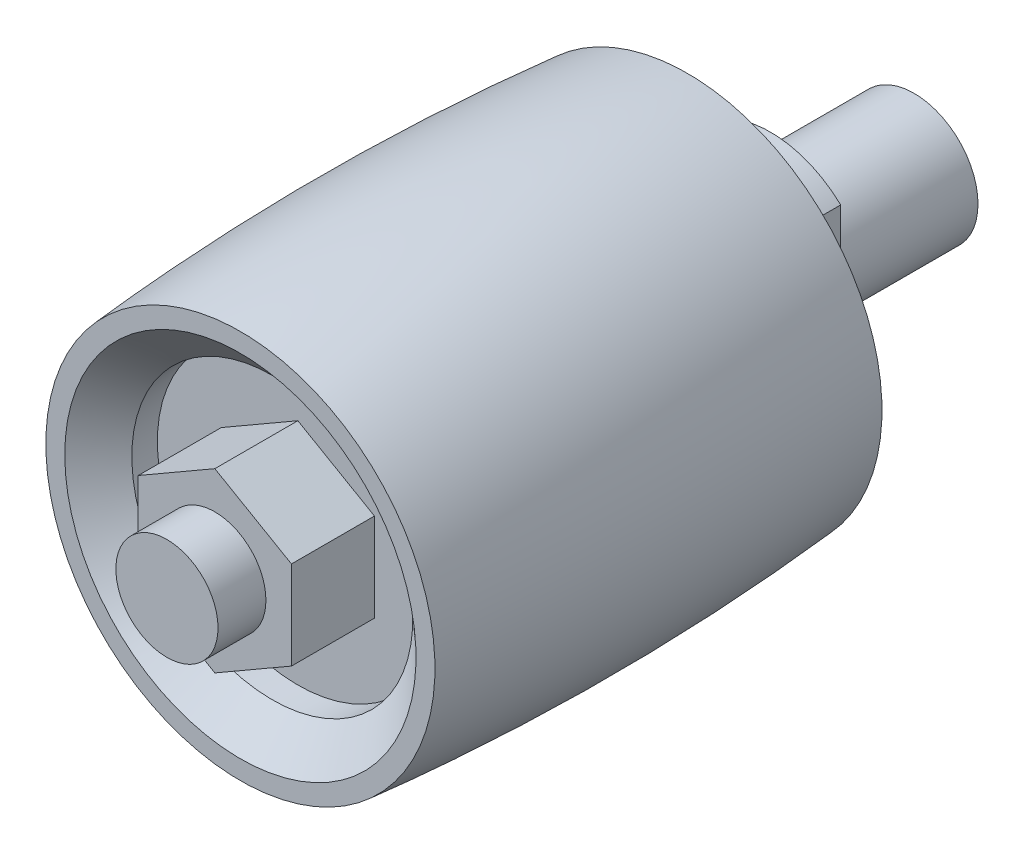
ISO-10303-21;
HEADER;
FILE_DESCRIPTION(('STEP AP214'),'2;1');
FILE_NAME('part.step','',(''),(''),'','','');
FILE_SCHEMA(('AUTOMOTIVE_DESIGN { 1 0 10303 214 1 1 1 1 }'));
ENDSEC;
DATA;
#1=APPLICATION_CONTEXT('core data for automotive mechanical design processes');
#2=APPLICATION_PROTOCOL_DEFINITION('international standard','automotive_design',2000,#1);
#3=PRODUCT_CONTEXT('',#1,'mechanical');
#4=PRODUCT('Part','Part','',(#3));
#5=PRODUCT_RELATED_PRODUCT_CATEGORY('part','',(#4));
#6=PRODUCT_DEFINITION_FORMATION('','',#4);
#7=PRODUCT_DEFINITION_CONTEXT('part definition',#1,'design');
#8=PRODUCT_DEFINITION('design','',#6,#7);
#9=PRODUCT_DEFINITION_SHAPE('','',#8);
#10=(LENGTH_UNIT() NAMED_UNIT(*) SI_UNIT(.MILLI.,.METRE.));
#11=(NAMED_UNIT(*) PLANE_ANGLE_UNIT() SI_UNIT($,.RADIAN.));
#12=(NAMED_UNIT(*) SI_UNIT($,.STERADIAN.) SOLID_ANGLE_UNIT());
#13=UNCERTAINTY_MEASURE_WITH_UNIT(LENGTH_MEASURE(1.E-05),#10,'distance_accuracy_value','');
#14=(GEOMETRIC_REPRESENTATION_CONTEXT(3) GLOBAL_UNCERTAINTY_ASSIGNED_CONTEXT((#13)) GLOBAL_UNIT_ASSIGNED_CONTEXT((#10,
#11,#12)) REPRESENTATION_CONTEXT('',''));
#15=CARTESIAN_POINT('',(0.,0.,0.));
#16=DIRECTION('',(0.,0.,1.));
#17=DIRECTION('',(1.,0.,0.));
#18=AXIS2_PLACEMENT_3D('',#15,#16,#17);
#19=CARTESIAN_POINT('',(0.,0.,28.));
#20=DIRECTION('',(0.,0.,-1.));
#21=DIRECTION('',(-0.381849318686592,0.924224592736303,0.));
#22=AXIS2_PLACEMENT_3D('',#19,#20,#21);
#23=CYLINDRICAL_SURFACE('',#22,22.);
#24=CARTESIAN_POINT('',(0.,0.,78.));
#25=DIRECTION('',(0.,0.,-1.));
#26=DIRECTION('',(-0.381849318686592,0.924224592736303,0.));
#27=AXIS2_PLACEMENT_3D('',#24,#25,#26);
#28=CIRCLE('',#27,22.);
#29=CARTESIAN_POINT('',(-8.40068501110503,20.3329410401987,78.));
#30=VERTEX_POINT('',#29);
#31=EDGE_CURVE('E194',#30,#30,#28,.T.);
#32=ORIENTED_EDGE('',*,*,#31,.F.);
#33=EDGE_LOOP('',(#32));
#34=FACE_BOUND('',#33,.T.);
#35=CARTESIAN_POINT('',(0.,0.,74.));
#36=DIRECTION('',(0.,0.,-1.));
#37=DIRECTION('',(-0.381849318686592,0.924224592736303,0.));
#38=AXIS2_PLACEMENT_3D('',#35,#36,#37);
#39=CIRCLE('',#38,22.);
#40=CARTESIAN_POINT('',(-8.40068501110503,20.3329410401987,74.));
#41=VERTEX_POINT('',#40);
#42=EDGE_CURVE('E19',#41,#41,#39,.T.);
#43=ORIENTED_EDGE('',*,*,#42,.T.);
#44=EDGE_LOOP('',(#43));
#45=FACE_BOUND('',#44,.T.);
#46=ADVANCED_FACE('F15',(#34,#45),#23,.F.);
#47=CARTESIAN_POINT('',(0.,0.,78.));
#48=DIRECTION('',(0.,0.,1.));
#49=DIRECTION('',(0.381849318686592,-0.924224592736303,0.));
#50=AXIS2_PLACEMENT_3D('',#47,#48,#49);
#51=CONICAL_SURFACE('',#50,22.,0.832981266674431);
#52=CARTESIAN_POINT('',(0.,0.,83.));
#53=DIRECTION('',(0.,0.,-1.));
#54=DIRECTION('',(-0.381849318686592,0.924224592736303,0.));
#55=AXIS2_PLACEMENT_3D('',#52,#53,#54);
#56=CIRCLE('',#55,27.5);
#57=CARTESIAN_POINT('',(-10.5008562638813,25.4161763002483,83.));
#58=VERTEX_POINT('',#57);
#59=EDGE_CURVE('E192',#58,#58,#56,.T.);
#60=ORIENTED_EDGE('',*,*,#59,.F.);
#61=EDGE_LOOP('',(#60));
#62=FACE_BOUND('',#61,.T.);
#63=ORIENTED_EDGE('',*,*,#31,.T.);
#64=EDGE_LOOP('',(#63));
#65=FACE_BOUND('',#64,.T.);
#66=ADVANCED_FACE('F279',(#62,#65),#51,.F.);
#67=CARTESIAN_POINT('',(30.0372992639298,12.4101028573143,83.));
#68=DIRECTION('',(0.,0.,1.));
#69=DIRECTION('',(0.381849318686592,-0.924224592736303,0.));
#70=AXIS2_PLACEMENT_3D('',#67,#68,#69);
#71=PLANE('',#70);
#72=CARTESIAN_POINT('',(0.,0.,83.));
#73=DIRECTION('',(0.,0.,-1.));
#74=DIRECTION('',(-0.381849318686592,0.924224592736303,0.));
#75=AXIS2_PLACEMENT_3D('',#72,#73,#74);
#76=CIRCLE('',#75,30.4658078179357);
#77=CARTESIAN_POINT('',(-11.6333479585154,28.1572488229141,83.));
#78=VERTEX_POINT('',#77);
#79=EDGE_CURVE('E180',#78,#78,#76,.T.);
#80=ORIENTED_EDGE('',*,*,#79,.F.);
#81=EDGE_LOOP('',(#80));
#82=FACE_BOUND('',#81,.T.);
#83=ORIENTED_EDGE('',*,*,#59,.T.);
#84=EDGE_LOOP('',(#83));
#85=FACE_BOUND('',#84,.T.);
#86=ADVANCED_FACE('F264',(#82,#85),#71,.T.);
#87=CARTESIAN_POINT('',(0.,0.,48.));
#88=DIRECTION('',(0.,0.,-1.));
#89=DIRECTION('',(-0.381849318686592,0.924224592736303,0.));
#90=AXIS2_PLACEMENT_3D('',#87,#88,#89);
#91=DEGENERATE_TOROIDAL_SURFACE('',#90,368.,400.,.F.);
#92=CARTESIAN_POINT('',(0.,0.,13.));
#93=DIRECTION('',(0.,0.,-1.));
#94=DIRECTION('',(-0.381849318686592,0.924224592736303,0.));
#95=AXIS2_PLACEMENT_3D('',#92,#93,#94);
#96=CIRCLE('',#95,30.4658078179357);
#97=CARTESIAN_POINT('',(-11.6333479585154,28.1572488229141,13.));
#98=VERTEX_POINT('',#97);
#99=EDGE_CURVE('E177',#98,#98,#96,.T.);
#100=ORIENTED_EDGE('',*,*,#99,.F.);
#101=EDGE_LOOP('',(#100));
#102=FACE_BOUND('',#101,.T.);
#103=ORIENTED_EDGE('',*,*,#79,.T.);
#104=EDGE_LOOP('',(#103));
#105=FACE_BOUND('',#104,.T.);
#106=ADVANCED_FACE('F260',(#102,#105),#91,.F.);
#107=CARTESIAN_POINT('',(30.0372992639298,12.4101028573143,13.));
#108=DIRECTION('',(0.,0.,1.));
#109=DIRECTION('',(0.381849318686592,-0.924224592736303,0.));
#110=AXIS2_PLACEMENT_3D('',#107,#108,#109);
#111=PLANE('',#110);
#112=ORIENTED_EDGE('',*,*,#99,.T.);
#113=EDGE_LOOP('',(#112));
#114=FACE_BOUND('',#113,.T.);
#115=CARTESIAN_POINT('',(0.,0.,13.));
#116=DIRECTION('',(0.,0.,-1.));
#117=DIRECTION('',(-0.381849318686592,0.924224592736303,0.));
#118=AXIS2_PLACEMENT_3D('',#115,#116,#117);
#119=CIRCLE('',#118,27.5);
#120=CARTESIAN_POINT('',(-10.5008562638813,25.4161763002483,13.));
#121=VERTEX_POINT('',#120);
#122=EDGE_CURVE('E189',#121,#121,#119,.T.);
#123=ORIENTED_EDGE('',*,*,#122,.F.);
#124=EDGE_LOOP('',(#123));
#125=FACE_BOUND('',#124,.T.);
#126=ADVANCED_FACE('F263',(#114,#125),#111,.F.);
#127=CARTESIAN_POINT('',(0.,0.,18.));
#128=DIRECTION('',(0.,0.,-1.));
#129=DIRECTION('',(-0.381849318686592,0.924224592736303,0.));
#130=AXIS2_PLACEMENT_3D('',#127,#128,#129);
#131=CONICAL_SURFACE('',#130,22.,0.832981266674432);
#132=ORIENTED_EDGE('',*,*,#122,.T.);
#133=EDGE_LOOP('',(#132));
#134=FACE_BOUND('',#133,.T.);
#135=CARTESIAN_POINT('',(0.,0.,18.));
#136=DIRECTION('',(0.,0.,-1.));
#137=DIRECTION('',(-0.381849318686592,0.924224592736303,0.));
#138=AXIS2_PLACEMENT_3D('',#135,#136,#137);
#139=CIRCLE('',#138,22.);
#140=CARTESIAN_POINT('',(-8.40068501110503,20.3329410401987,18.));
#141=VERTEX_POINT('',#140);
#142=EDGE_CURVE('E186',#141,#141,#139,.T.);
#143=ORIENTED_EDGE('',*,*,#142,.F.);
#144=EDGE_LOOP('',(#143));
#145=FACE_BOUND('',#144,.T.);
#146=ADVANCED_FACE('F269',(#134,#145),#131,.F.);
#147=CARTESIAN_POINT('',(0.,0.,28.));
#148=DIRECTION('',(0.,0.,-1.));
#149=DIRECTION('',(-0.381849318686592,0.924224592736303,0.));
#150=AXIS2_PLACEMENT_3D('',#147,#148,#149);
#151=CYLINDRICAL_SURFACE('',#150,22.);
#152=ORIENTED_EDGE('',*,*,#142,.T.);
#153=EDGE_LOOP('',(#152));
#154=FACE_BOUND('',#153,.T.);
#155=CARTESIAN_POINT('',(0.,0.,22.));
#156=DIRECTION('',(0.,0.,-1.));
#157=DIRECTION('',(-0.381849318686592,0.924224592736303,0.));
#158=AXIS2_PLACEMENT_3D('',#155,#156,#157);
#159=CIRCLE('',#158,22.);
#160=CARTESIAN_POINT('',(-8.40068501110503,20.3329410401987,22.));
#161=VERTEX_POINT('',#160);
#162=EDGE_CURVE('E183',#161,#161,#159,.T.);
#163=ORIENTED_EDGE('',*,*,#162,.F.);
#164=EDGE_LOOP('',(#163));
#165=FACE_BOUND('',#164,.T.);
#166=ADVANCED_FACE('F266',(#154,#165),#151,.F.);
#167=CARTESIAN_POINT('',(9.24224592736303,3.81849318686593,22.));
#168=DIRECTION('',(0.,0.,-1.));
#169=DIRECTION('',(-0.381849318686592,0.924224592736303,0.));
#170=AXIS2_PLACEMENT_3D('',#167,#168,#169);
#171=PLANE('',#170);
#172=DIRECTION('',(0.,-1.,0.));
#173=VECTOR('',#172,1.);
#174=CARTESIAN_POINT('',(11.,11.6189500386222,22.));
#175=LINE('',#174,#173);
#176=CARTESIAN_POINT('',(11.,11.6189500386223,22.));
#177=VERTEX_POINT('',#176);
#178=CARTESIAN_POINT('',(11.,-11.6189500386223,22.));
#179=VERTEX_POINT('',#178);
#180=EDGE_CURVE('E64',#177,#179,#175,.T.);
#181=ORIENTED_EDGE('',*,*,#180,.F.);
#182=CARTESIAN_POINT('',(0.,0.,22.));
#183=DIRECTION('',(0.,0.,1.));
#184=DIRECTION('',(1.,0.,0.));
#185=AXIS2_PLACEMENT_3D('',#182,#183,#184);
#186=CIRCLE('',#185,16.);
#187=CARTESIAN_POINT('',(-11.,11.6189500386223,22.));
#188=VERTEX_POINT('',#187);
#189=EDGE_CURVE('E170',#177,#188,#186,.T.);
#190=ORIENTED_EDGE('',*,*,#189,.T.);
#191=DIRECTION('',(0.,-1.,0.));
#192=VECTOR('',#191,1.);
#193=CARTESIAN_POINT('',(-11.,11.6189500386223,22.));
#194=LINE('',#193,#192);
#195=CARTESIAN_POINT('',(-11.,-11.6189500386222,22.));
#196=VERTEX_POINT('',#195);
#197=EDGE_CURVE('E139',#188,#196,#194,.T.);
#198=ORIENTED_EDGE('',*,*,#197,.T.);
#199=EDGE_CURVE('E71',#196,#179,#186,.T.);
#200=ORIENTED_EDGE('',*,*,#199,.T.);
#201=EDGE_LOOP('',(#181,#190,#198,#200));
#202=FACE_BOUND('',#201,.T.);
#203=ORIENTED_EDGE('',*,*,#162,.T.);
#204=EDGE_LOOP('',(#203));
#205=FACE_BOUND('',#204,.T.);
#206=ADVANCED_FACE('F17',(#202,#205),#171,.T.);
#207=CARTESIAN_POINT('',(11.,11.6189500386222,-22.5));
#208=DIRECTION('',(-1.,0.,0.));
#209=DIRECTION('',(0.,0.,1.));
#210=AXIS2_PLACEMENT_3D('',#207,#208,#209);
#211=PLANE('',#210);
#212=DIRECTION('',(0.,0.,1.));
#213=VECTOR('',#212,1.);
#214=CARTESIAN_POINT('',(11.,11.6189500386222,-22.5));
#215=LINE('',#214,#213);
#216=CARTESIAN_POINT('',(11.,11.6189500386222,0.));
#217=VERTEX_POINT('',#216);
#218=EDGE_CURVE('E150',#217,#177,#215,.T.);
#219=ORIENTED_EDGE('',*,*,#218,.T.);
#220=ORIENTED_EDGE('',*,*,#180,.T.);
#221=DIRECTION('',(0.,0.,1.));
#222=VECTOR('',#221,1.);
#223=CARTESIAN_POINT('',(11.,-11.6189500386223,-22.5));
#224=LINE('',#223,#222);
#225=CARTESIAN_POINT('',(11.,-11.6189500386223,0.));
#226=VERTEX_POINT('',#225);
#227=EDGE_CURVE('E153',#226,#179,#224,.T.);
#228=ORIENTED_EDGE('',*,*,#227,.F.);
#229=DIRECTION('',(0.,-1.,0.));
#230=VECTOR('',#229,1.);
#231=CARTESIAN_POINT('',(11.,0.,0.));
#232=LINE('',#231,#230);
#233=EDGE_CURVE('E155',#217,#226,#232,.T.);
#234=ORIENTED_EDGE('',*,*,#233,.F.);
#235=EDGE_LOOP('',(#219,#220,#228,#234));
#236=FACE_BOUND('',#235,.T.);
#237=ADVANCED_FACE('F204',(#236),#211,.F.);
#238=CARTESIAN_POINT('',(0.,0.,22.));
#239=DIRECTION('',(0.,0.,-1.));
#240=DIRECTION('',(-1.,0.,0.));
#241=AXIS2_PLACEMENT_3D('',#238,#239,#240);
#242=CYLINDRICAL_SURFACE('',#241,16.);
#243=DIRECTION('',(0.,0.,1.));
#244=VECTOR('',#243,1.);
#245=CARTESIAN_POINT('',(-11.,11.6189500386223,-22.5));
#246=LINE('',#245,#244);
#247=CARTESIAN_POINT('',(-11.,11.6189500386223,0.));
#248=VERTEX_POINT('',#247);
#249=EDGE_CURVE('E144',#248,#188,#246,.T.);
#250=ORIENTED_EDGE('',*,*,#249,.T.);
#251=ORIENTED_EDGE('',*,*,#189,.F.);
#252=ORIENTED_EDGE('',*,*,#218,.F.);
#253=CARTESIAN_POINT('',(0.,0.,0.));
#254=DIRECTION('',(0.,0.,1.));
#255=DIRECTION('',(1.,0.,0.));
#256=AXIS2_PLACEMENT_3D('',#253,#254,#255);
#257=CIRCLE('',#256,16.);
#258=EDGE_CURVE('E167',#217,#248,#257,.T.);
#259=ORIENTED_EDGE('',*,*,#258,.T.);
#260=EDGE_LOOP('',(#250,#251,#252,#259));
#261=FACE_BOUND('',#260,.T.);
#262=ADVANCED_FACE('F217',(#261),#242,.T.);
#263=CARTESIAN_POINT('',(-11.,11.6189500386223,-22.5));
#264=DIRECTION('',(-1.,0.,0.));
#265=DIRECTION('',(0.,-1.,0.));
#266=AXIS2_PLACEMENT_3D('',#263,#264,#265);
#267=PLANE('',#266);
#268=DIRECTION('',(0.,-1.,0.));
#269=VECTOR('',#268,1.);
#270=CARTESIAN_POINT('',(-11.,0.,0.));
#271=LINE('',#270,#269);
#272=CARTESIAN_POINT('',(-11.,-11.6189500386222,0.));
#273=VERTEX_POINT('',#272);
#274=EDGE_CURVE('E147',#248,#273,#271,.T.);
#275=ORIENTED_EDGE('',*,*,#274,.T.);
#276=DIRECTION('',(0.,0.,1.));
#277=VECTOR('',#276,1.);
#278=CARTESIAN_POINT('',(-11.,-11.6189500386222,-22.5));
#279=LINE('',#278,#277);
#280=EDGE_CURVE('E141',#273,#196,#279,.T.);
#281=ORIENTED_EDGE('',*,*,#280,.T.);
#282=ORIENTED_EDGE('',*,*,#197,.F.);
#283=ORIENTED_EDGE('',*,*,#249,.F.);
#284=EDGE_LOOP('',(#275,#281,#282,#283));
#285=FACE_BOUND('',#284,.T.);
#286=ADVANCED_FACE('F220',(#285),#267,.T.);
#287=ORIENTED_EDGE('',*,*,#280,.F.);
#288=EDGE_CURVE('E166',#273,#226,#257,.T.);
#289=ORIENTED_EDGE('',*,*,#288,.T.);
#290=ORIENTED_EDGE('',*,*,#227,.T.);
#291=ORIENTED_EDGE('',*,*,#199,.F.);
#292=EDGE_LOOP('',(#287,#289,#290,#291));
#293=FACE_BOUND('',#292,.T.);
#294=ADVANCED_FACE('F249',(#293),#242,.T.);
#295=CARTESIAN_POINT('',(0.,0.,0.));
#296=DIRECTION('',(0.,0.,1.));
#297=DIRECTION('',(1.,0.,0.));
#298=AXIS2_PLACEMENT_3D('',#295,#296,#297);
#299=PLANE('',#298);
#300=CARTESIAN_POINT('',(0.,0.,0.));
#301=DIRECTION('',(0.,0.,1.));
#302=DIRECTION('',(1.,0.,0.));
#303=AXIS2_PLACEMENT_3D('',#300,#301,#302);
#304=CIRCLE('',#303,10.);
#305=CARTESIAN_POINT('',(10.,0.,0.));
#306=VERTEX_POINT('',#305);
#307=EDGE_CURVE('E163',#306,#306,#304,.T.);
#308=ORIENTED_EDGE('',*,*,#307,.T.);
#309=EDGE_LOOP('',(#308));
#310=FACE_BOUND('',#309,.T.);
#311=ORIENTED_EDGE('',*,*,#274,.F.);
#312=ORIENTED_EDGE('',*,*,#258,.F.);
#313=ORIENTED_EDGE('',*,*,#233,.T.);
#314=ORIENTED_EDGE('',*,*,#288,.F.);
#315=EDGE_LOOP('',(#311,#312,#313,#314));
#316=FACE_BOUND('',#315,.T.);
#317=ADVANCED_FACE('F245',(#310,#316),#299,.F.);
#318=CARTESIAN_POINT('',(0.,0.,0.));
#319=DIRECTION('',(0.,0.,-1.));
#320=DIRECTION('',(-1.,0.,0.));
#321=AXIS2_PLACEMENT_3D('',#318,#319,#320);
#322=CYLINDRICAL_SURFACE('',#321,10.);
#323=ORIENTED_EDGE('',*,*,#307,.F.);
#324=EDGE_LOOP('',(#323));
#325=FACE_BOUND('',#324,.T.);
#326=CARTESIAN_POINT('',(0.,0.,-22.5));
#327=DIRECTION('',(0.,0.,1.));
#328=DIRECTION('',(1.,0.,0.));
#329=AXIS2_PLACEMENT_3D('',#326,#327,#328);
#330=CIRCLE('',#329,10.);
#331=CARTESIAN_POINT('',(10.,0.,-22.5));
#332=VERTEX_POINT('',#331);
#333=EDGE_CURVE('E172',#332,#332,#330,.T.);
#334=ORIENTED_EDGE('',*,*,#333,.T.);
#335=EDGE_LOOP('',(#334));
#336=FACE_BOUND('',#335,.T.);
#337=ADVANCED_FACE('F248',(#325,#336),#322,.T.);
#338=CARTESIAN_POINT('',(0.,0.,-22.5));
#339=DIRECTION('',(0.,0.,1.));
#340=DIRECTION('',(1.,0.,0.));
#341=AXIS2_PLACEMENT_3D('',#338,#339,#340);
#342=PLANE('',#341);
#343=ORIENTED_EDGE('',*,*,#333,.F.);
#344=EDGE_LOOP('',(#343));
#345=FACE_BOUND('',#344,.T.);
#346=ADVANCED_FACE('F232',(#345),#342,.F.);
#347=CARTESIAN_POINT('',(0.,0.,94.5));
#348=DIRECTION('',(0.,0.,-1.));
#349=DIRECTION('',(-1.,0.,0.));
#350=AXIS2_PLACEMENT_3D('',#347,#348,#349);
#351=CYLINDRICAL_SURFACE('',#350,8.);
#352=CARTESIAN_POINT('',(0.,0.,94.5));
#353=DIRECTION('',(0.,0.,1.));
#354=DIRECTION('',(1.,0.,0.));
#355=AXIS2_PLACEMENT_3D('',#352,#353,#354);
#356=CIRCLE('',#355,8.);
#357=CARTESIAN_POINT('',(8.,0.,94.5));
#358=VERTEX_POINT('',#357);
#359=EDGE_CURVE('E158',#358,#358,#356,.T.);
#360=ORIENTED_EDGE('',*,*,#359,.F.);
#361=EDGE_LOOP('',(#360));
#362=FACE_BOUND('',#361,.T.);
#363=CARTESIAN_POINT('',(0.,0.,87.));
#364=DIRECTION('',(0.,0.,1.));
#365=DIRECTION('',(1.,0.,0.));
#366=AXIS2_PLACEMENT_3D('',#363,#364,#365);
#367=CIRCLE('',#366,8.);
#368=CARTESIAN_POINT('',(8.,0.,87.));
#369=VERTEX_POINT('',#368);
#370=EDGE_CURVE('E162',#369,#369,#367,.T.);
#371=ORIENTED_EDGE('',*,*,#370,.T.);
#372=EDGE_LOOP('',(#371));
#373=FACE_BOUND('',#372,.T.);
#374=ADVANCED_FACE('F213',(#362,#373),#351,.T.);
#375=CARTESIAN_POINT('',(0.,0.,94.5));
#376=DIRECTION('',(0.,0.,1.));
#377=DIRECTION('',(1.,0.,0.));
#378=AXIS2_PLACEMENT_3D('',#375,#376,#377);
#379=PLANE('',#378);
#380=ORIENTED_EDGE('',*,*,#359,.T.);
#381=EDGE_LOOP('',(#380));
#382=FACE_BOUND('',#381,.T.);
#383=ADVANCED_FACE('F223',(#382),#379,.T.);
#384=CARTESIAN_POINT('',(-11.9944518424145,20.775,87.));
#385=DIRECTION('',(0.,0.,1.));
#386=DIRECTION('',(1.,0.,0.));
#387=AXIS2_PLACEMENT_3D('',#384,#385,#386);
#388=PLANE('',#387);
#389=ORIENTED_EDGE('',*,*,#370,.F.);
#390=EDGE_LOOP('',(#389));
#391=FACE_BOUND('',#390,.T.);
#392=DIRECTION('',(-0.866025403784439,0.5,0.));
#393=VECTOR('',#392,1.);
#394=CARTESIAN_POINT('',(11.9944518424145,6.925,87.));
#395=LINE('',#394,#393);
#396=CARTESIAN_POINT('',(11.9944518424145,6.925,87.));
#397=VERTEX_POINT('',#396);
#398=CARTESIAN_POINT('',(0.,13.85,87.));
#399=VERTEX_POINT('',#398);
#400=EDGE_CURVE('E507',#397,#399,#395,.T.);
#401=ORIENTED_EDGE('',*,*,#400,.T.);
#402=DIRECTION('',(-0.866025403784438,-0.5,0.));
#403=VECTOR('',#402,1.);
#404=CARTESIAN_POINT('',(0.,13.85,87.));
#405=LINE('',#404,#403);
#406=CARTESIAN_POINT('',(-11.9944518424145,6.925,87.));
#407=VERTEX_POINT('',#406);
#408=EDGE_CURVE('E510',#399,#407,#405,.T.);
#409=ORIENTED_EDGE('',*,*,#408,.T.);
#410=DIRECTION('',(0.,-1.,0.));
#411=VECTOR('',#410,1.);
#412=CARTESIAN_POINT('',(-11.9944518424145,6.925,87.));
#413=LINE('',#412,#411);
#414=CARTESIAN_POINT('',(-11.9944518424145,-6.925,87.));
#415=VERTEX_POINT('',#414);
#416=EDGE_CURVE('E513',#407,#415,#413,.T.);
#417=ORIENTED_EDGE('',*,*,#416,.T.);
#418=DIRECTION('',(0.866025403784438,-0.5,0.));
#419=VECTOR('',#418,1.);
#420=CARTESIAN_POINT('',(-11.9944518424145,-6.925,87.));
#421=LINE('',#420,#419);
#422=CARTESIAN_POINT('',(0.,-13.85,87.));
#423=VERTEX_POINT('',#422);
#424=EDGE_CURVE('E516',#415,#423,#421,.T.);
#425=ORIENTED_EDGE('',*,*,#424,.T.);
#426=DIRECTION('',(0.866025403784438,0.5,0.));
#427=VECTOR('',#426,1.);
#428=CARTESIAN_POINT('',(0.,-13.85,87.));
#429=LINE('',#428,#427);
#430=CARTESIAN_POINT('',(11.9944518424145,-6.925,87.));
#431=VERTEX_POINT('',#430);
#432=EDGE_CURVE('E123',#423,#431,#429,.T.);
#433=ORIENTED_EDGE('',*,*,#432,.T.);
#434=DIRECTION('',(0.,1.,0.));
#435=VECTOR('',#434,1.);
#436=CARTESIAN_POINT('',(11.9944518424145,-6.925,87.));
#437=LINE('',#436,#435);
#438=EDGE_CURVE('E519',#431,#397,#437,.T.);
#439=ORIENTED_EDGE('',*,*,#438,.T.);
#440=EDGE_LOOP('',(#401,#409,#417,#425,#433,#439));
#441=FACE_BOUND('',#440,.T.);
#442=ADVANCED_FACE('F205',(#391,#441),#388,.T.);
#443=CARTESIAN_POINT('',(11.9944518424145,6.925,87.));
#444=DIRECTION('',(-0.5,-0.866025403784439,0.));
#445=DIRECTION('',(0.866025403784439,-0.5,0.));
#446=AXIS2_PLACEMENT_3D('',#443,#444,#445);
#447=PLANE('',#446);
#448=DIRECTION('',(0.,0.,-1.));
#449=VECTOR('',#448,1.);
#450=CARTESIAN_POINT('',(0.,13.85,87.));
#451=LINE('',#450,#449);
#452=CARTESIAN_POINT('',(0.,13.85,74.));
#453=VERTEX_POINT('',#452);
#454=EDGE_CURVE('E134',#399,#453,#451,.T.);
#455=ORIENTED_EDGE('',*,*,#454,.F.);
#456=ORIENTED_EDGE('',*,*,#400,.F.);
#457=DIRECTION('',(0.,0.,-1.));
#458=VECTOR('',#457,1.);
#459=CARTESIAN_POINT('',(11.9944518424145,6.925,87.));
#460=LINE('',#459,#458);
#461=CARTESIAN_POINT('',(11.9944518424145,6.925,74.));
#462=VERTEX_POINT('',#461);
#463=EDGE_CURVE('E128',#397,#462,#460,.T.);
#464=ORIENTED_EDGE('',*,*,#463,.T.);
#465=DIRECTION('',(-0.866025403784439,0.5,0.));
#466=VECTOR('',#465,1.);
#467=CARTESIAN_POINT('',(11.9944518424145,6.925,74.));
#468=LINE('',#467,#466);
#469=EDGE_CURVE('E35',#462,#453,#468,.T.);
#470=ORIENTED_EDGE('',*,*,#469,.T.);
#471=EDGE_LOOP('',(#455,#456,#464,#470));
#472=FACE_BOUND('',#471,.T.);
#473=ADVANCED_FACE('F222',(#472),#447,.F.);
#474=CARTESIAN_POINT('',(0.,13.85,87.));
#475=DIRECTION('',(0.5,-0.866025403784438,0.));
#476=DIRECTION('',(0.866025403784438,0.5,0.));
#477=AXIS2_PLACEMENT_3D('',#474,#475,#476);
#478=PLANE('',#477);
#479=DIRECTION('',(0.,0.,-1.));
#480=VECTOR('',#479,1.);
#481=CARTESIAN_POINT('',(-11.9944518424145,6.925,87.));
#482=LINE('',#481,#480);
#483=CARTESIAN_POINT('',(-11.9944518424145,6.925,74.));
#484=VERTEX_POINT('',#483);
#485=EDGE_CURVE('E126',#407,#484,#482,.T.);
#486=ORIENTED_EDGE('',*,*,#485,.F.);
#487=ORIENTED_EDGE('',*,*,#408,.F.);
#488=ORIENTED_EDGE('',*,*,#454,.T.);
#489=DIRECTION('',(-0.866025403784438,-0.5,0.));
#490=VECTOR('',#489,1.);
#491=CARTESIAN_POINT('',(0.,13.85,74.));
#492=LINE('',#491,#490);
#493=EDGE_CURVE('E499',#453,#484,#492,.T.);
#494=ORIENTED_EDGE('',*,*,#493,.T.);
#495=EDGE_LOOP('',(#486,#487,#488,#494));
#496=FACE_BOUND('',#495,.T.);
#497=ADVANCED_FACE('F364',(#496),#478,.F.);
#498=CARTESIAN_POINT('',(-11.9944518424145,6.925,87.));
#499=DIRECTION('',(1.,0.,0.));
#500=DIRECTION('',(0.,0.,-1.));
#501=AXIS2_PLACEMENT_3D('',#498,#499,#500);
#502=PLANE('',#501);
#503=DIRECTION('',(0.,0.,-1.));
#504=VECTOR('',#503,1.);
#505=CARTESIAN_POINT('',(-11.9944518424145,-6.925,87.));
#506=LINE('',#505,#504);
#507=CARTESIAN_POINT('',(-11.9944518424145,-6.925,74.));
#508=VERTEX_POINT('',#507);
#509=EDGE_CURVE('E118',#415,#508,#506,.T.);
#510=ORIENTED_EDGE('',*,*,#509,.F.);
#511=ORIENTED_EDGE('',*,*,#416,.F.);
#512=ORIENTED_EDGE('',*,*,#485,.T.);
#513=DIRECTION('',(0.,-1.,0.));
#514=VECTOR('',#513,1.);
#515=CARTESIAN_POINT('',(-11.9944518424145,6.925,74.));
#516=LINE('',#515,#514);
#517=EDGE_CURVE('E78',#484,#508,#516,.T.);
#518=ORIENTED_EDGE('',*,*,#517,.T.);
#519=EDGE_LOOP('',(#510,#511,#512,#518));
#520=FACE_BOUND('',#519,.T.);
#521=ADVANCED_FACE('F374',(#520),#502,.F.);
#522=CARTESIAN_POINT('',(-11.9944518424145,-6.925,87.));
#523=DIRECTION('',(0.5,0.866025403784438,0.));
#524=DIRECTION('',(-0.866025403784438,0.5,0.));
#525=AXIS2_PLACEMENT_3D('',#522,#523,#524);
#526=PLANE('',#525);
#527=DIRECTION('',(0.,0.,-1.));
#528=VECTOR('',#527,1.);
#529=CARTESIAN_POINT('',(0.,-13.85,87.));
#530=LINE('',#529,#528);
#531=CARTESIAN_POINT('',(0.,-13.85,74.));
#532=VERTEX_POINT('',#531);
#533=EDGE_CURVE('E116',#423,#532,#530,.T.);
#534=ORIENTED_EDGE('',*,*,#533,.F.);
#535=ORIENTED_EDGE('',*,*,#424,.F.);
#536=ORIENTED_EDGE('',*,*,#509,.T.);
#537=DIRECTION('',(0.866025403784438,-0.5,0.));
#538=VECTOR('',#537,1.);
#539=CARTESIAN_POINT('',(-11.9944518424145,-6.925,74.));
#540=LINE('',#539,#538);
#541=EDGE_CURVE('E106',#508,#532,#540,.T.);
#542=ORIENTED_EDGE('',*,*,#541,.T.);
#543=EDGE_LOOP('',(#534,#535,#536,#542));
#544=FACE_BOUND('',#543,.T.);
#545=ADVANCED_FACE('F114',(#544),#526,.F.);
#546=CARTESIAN_POINT('',(0.,-13.85,87.));
#547=DIRECTION('',(-0.5,0.866025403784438,0.));
#548=DIRECTION('',(-0.866025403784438,-0.5,0.));
#549=AXIS2_PLACEMENT_3D('',#546,#547,#548);
#550=PLANE('',#549);
#551=DIRECTION('',(0.,0.,-1.));
#552=VECTOR('',#551,1.);
#553=CARTESIAN_POINT('',(11.9944518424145,-6.925,87.));
#554=LINE('',#553,#552);
#555=CARTESIAN_POINT('',(11.9944518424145,-6.925,74.));
#556=VERTEX_POINT('',#555);
#557=EDGE_CURVE('E124',#431,#556,#554,.T.);
#558=ORIENTED_EDGE('',*,*,#557,.F.);
#559=ORIENTED_EDGE('',*,*,#432,.F.);
#560=ORIENTED_EDGE('',*,*,#533,.T.);
#561=DIRECTION('',(0.866025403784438,0.5,0.));
#562=VECTOR('',#561,1.);
#563=CARTESIAN_POINT('',(0.,-13.85,74.));
#564=LINE('',#563,#562);
#565=EDGE_CURVE('E102',#532,#556,#564,.T.);
#566=ORIENTED_EDGE('',*,*,#565,.T.);
#567=EDGE_LOOP('',(#558,#559,#560,#566));
#568=FACE_BOUND('',#567,.T.);
#569=ADVANCED_FACE('F121',(#568),#550,.F.);
#570=CARTESIAN_POINT('',(11.9944518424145,-6.925,87.));
#571=DIRECTION('',(-1.,0.,0.));
#572=DIRECTION('',(0.,-1.,0.));
#573=AXIS2_PLACEMENT_3D('',#570,#571,#572);
#574=PLANE('',#573);
#575=ORIENTED_EDGE('',*,*,#438,.F.);
#576=ORIENTED_EDGE('',*,*,#557,.T.);
#577=DIRECTION('',(0.,1.,0.));
#578=VECTOR('',#577,1.);
#579=CARTESIAN_POINT('',(11.9944518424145,-6.925,74.));
#580=LINE('',#579,#578);
#581=EDGE_CURVE('E107',#556,#462,#580,.T.);
#582=ORIENTED_EDGE('',*,*,#581,.T.);
#583=ORIENTED_EDGE('',*,*,#463,.F.);
#584=EDGE_LOOP('',(#575,#576,#582,#583));
#585=FACE_BOUND('',#584,.T.);
#586=ADVANCED_FACE('F202',(#585),#574,.F.);
#587=CARTESIAN_POINT('',(0.,0.,74.));
#588=DIRECTION('',(0.,0.,1.));
#589=DIRECTION('',(1.,0.,0.));
#590=AXIS2_PLACEMENT_3D('',#587,#588,#589);
#591=PLANE('',#590);
#592=ORIENTED_EDGE('',*,*,#469,.F.);
#593=ORIENTED_EDGE('',*,*,#581,.F.);
#594=ORIENTED_EDGE('',*,*,#565,.F.);
#595=ORIENTED_EDGE('',*,*,#541,.F.);
#596=ORIENTED_EDGE('',*,*,#517,.F.);
#597=ORIENTED_EDGE('',*,*,#493,.F.);
#598=EDGE_LOOP('',(#592,#593,#594,#595,#596,#597));
#599=FACE_BOUND('',#598,.T.);
#600=ORIENTED_EDGE('',*,*,#42,.F.);
#601=EDGE_LOOP('',(#600));
#602=FACE_BOUND('',#601,.T.);
#603=ADVANCED_FACE('F104',(#599,#602),#591,.T.);
#604=CLOSED_SHELL('',(#46,#66,#86,#106,#126,#146,#166,#206,#237,#262,#286,#294,#317,#337,#346,
#374,#383,#442,#473,#497,#521,#545,#569,#586,#603));
#605=CARTESIAN_POINT('',(0.,0.,74.));
#606=DIRECTION('',(0.,0.,-1.));
#607=DIRECTION('',(-1.,0.,0.));
#608=AXIS2_PLACEMENT_3D('',#605,#606,#607);
#609=CYLINDRICAL_SURFACE('',#608,8.1);
#610=CARTESIAN_POINT('',(0.,0.,74.));
#611=DIRECTION('',(0.,0.,1.));
#612=DIRECTION('',(1.,0.,0.));
#613=AXIS2_PLACEMENT_3D('',#610,#611,#612);
#614=CIRCLE('',#613,8.1);
#615=CARTESIAN_POINT('',(8.1,0.,74.));
#616=VERTEX_POINT('',#615);
#617=EDGE_CURVE('E26',#616,#616,#614,.T.);
#618=ORIENTED_EDGE('',*,*,#617,.T.);
#619=EDGE_LOOP('',(#618));
#620=FACE_BOUND('',#619,.T.);
#621=CARTESIAN_POINT('',(0.,0.,72.5));
#622=DIRECTION('',(0.,0.,1.));
#623=DIRECTION('',(1.,0.,0.));
#624=AXIS2_PLACEMENT_3D('',#621,#622,#623);
#625=CIRCLE('',#624,8.1);
#626=CARTESIAN_POINT('',(8.1,0.,72.5));
#627=VERTEX_POINT('',#626);
#628=EDGE_CURVE('E9',#627,#627,#625,.T.);
#629=ORIENTED_EDGE('',*,*,#628,.F.);
#630=EDGE_LOOP('',(#629));
#631=FACE_BOUND('',#630,.T.);
#632=ADVANCED_FACE('F415',(#620,#631),#609,.F.);
#633=CARTESIAN_POINT('',(-11.9944518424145,20.775,74.));
#634=DIRECTION('',(0.,0.,1.));
#635=DIRECTION('',(1.,0.,0.));
#636=AXIS2_PLACEMENT_3D('',#633,#634,#635);
#637=PLANE('',#636);
#638=CARTESIAN_POINT('',(0.,0.,74.));
#639=DIRECTION('',(0.,0.,1.));
#640=DIRECTION('',(1.,0.,0.));
#641=AXIS2_PLACEMENT_3D('',#638,#639,#640);
#642=CIRCLE('',#641,8.);
#643=CARTESIAN_POINT('',(8.,0.,74.));
#644=VERTEX_POINT('',#643);
#645=EDGE_CURVE('E491',#644,#644,#642,.T.);
#646=ORIENTED_EDGE('',*,*,#645,.T.);
#647=EDGE_LOOP('',(#646));
#648=FACE_BOUND('',#647,.T.);
#649=ORIENTED_EDGE('',*,*,#617,.F.);
#650=EDGE_LOOP('',(#649));
#651=FACE_BOUND('',#650,.T.);
#652=ADVANCED_FACE('F243',(#648,#651),#637,.F.);
#653=CARTESIAN_POINT('',(0.,0.,72.5));
#654=DIRECTION('',(0.,0.,1.));
#655=DIRECTION('',(1.,0.,0.));
#656=AXIS2_PLACEMENT_3D('',#653,#654,#655);
#657=PLANE('',#656);
#658=ORIENTED_EDGE('',*,*,#628,.T.);
#659=EDGE_LOOP('',(#658));
#660=FACE_BOUND('',#659,.T.);
#661=CARTESIAN_POINT('',(0.,0.,72.5));
#662=DIRECTION('',(0.,0.,1.));
#663=DIRECTION('',(1.,0.,0.));
#664=AXIS2_PLACEMENT_3D('',#661,#662,#663);
#665=CIRCLE('',#664,8.);
#666=CARTESIAN_POINT('',(8.,0.,72.5));
#667=VERTEX_POINT('',#666);
#668=EDGE_CURVE('E159',#667,#667,#665,.T.);
#669=ORIENTED_EDGE('',*,*,#668,.F.);
#670=EDGE_LOOP('',(#669));
#671=FACE_BOUND('',#670,.T.);
#672=ADVANCED_FACE('F238',(#660,#671),#657,.T.);
#673=ORIENTED_EDGE('',*,*,#645,.F.);
#674=EDGE_LOOP('',(#673));
#675=FACE_BOUND('',#674,.T.);
#676=ORIENTED_EDGE('',*,*,#668,.T.);
#677=EDGE_LOOP('',(#676));
#678=FACE_BOUND('',#677,.T.);
#679=ADVANCED_FACE('F235',(#675,#678),#351,.T.);
#680=CLOSED_SHELL('',(#632,#652,#672,#679));
#681=ORIENTED_CLOSED_SHELL('',*,#680,.T.);
#682=BREP_WITH_VOIDS('B1',#604,(#681));
#683=ADVANCED_BREP_SHAPE_REPRESENTATION('',(#18,#682),#14);
#684=SHAPE_DEFINITION_REPRESENTATION(#9,#683);
ENDSEC;
END-ISO-10303-21;
